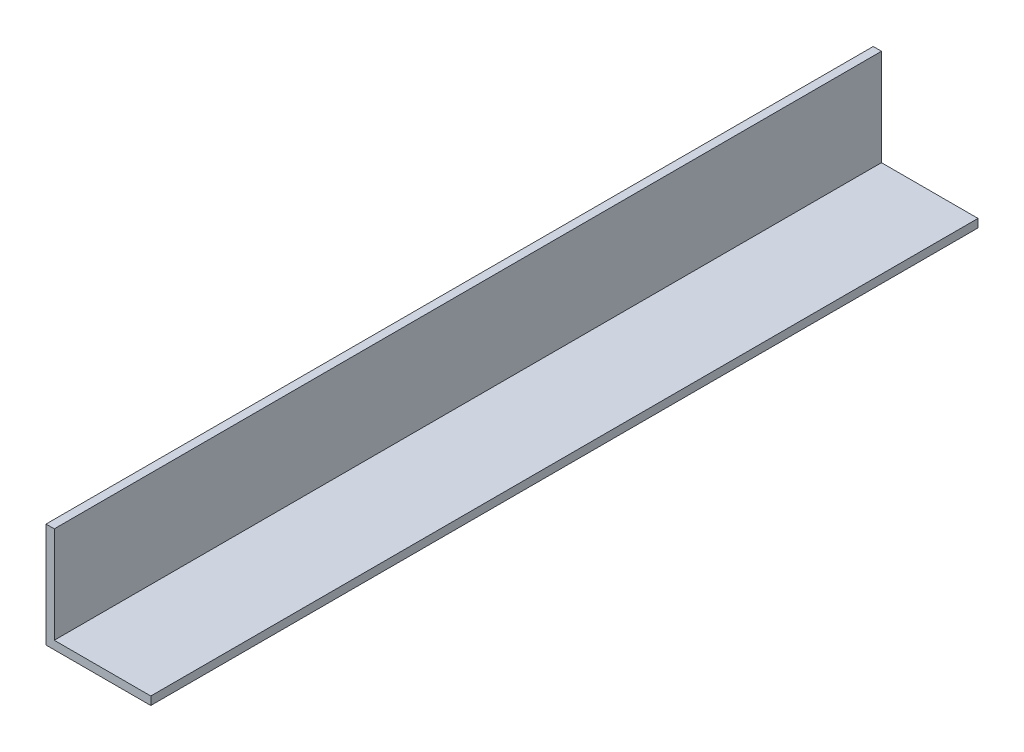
from build123d import *

# Parameters (mm, degrees)
EXTRUDE_1_DEPTH = 150


with BuildPart() as part:
    # Sketch 1 → Extrude 1 (new, symmetric)
    with BuildSketch(Plane.XY):
        Polygon((0, 0), (0, 38), (3, 38), (3, 3), (38, 3), (38, 0), align=None)
    extrude(amount=EXTRUDE_1_DEPTH, both=True)


solid = part.part
